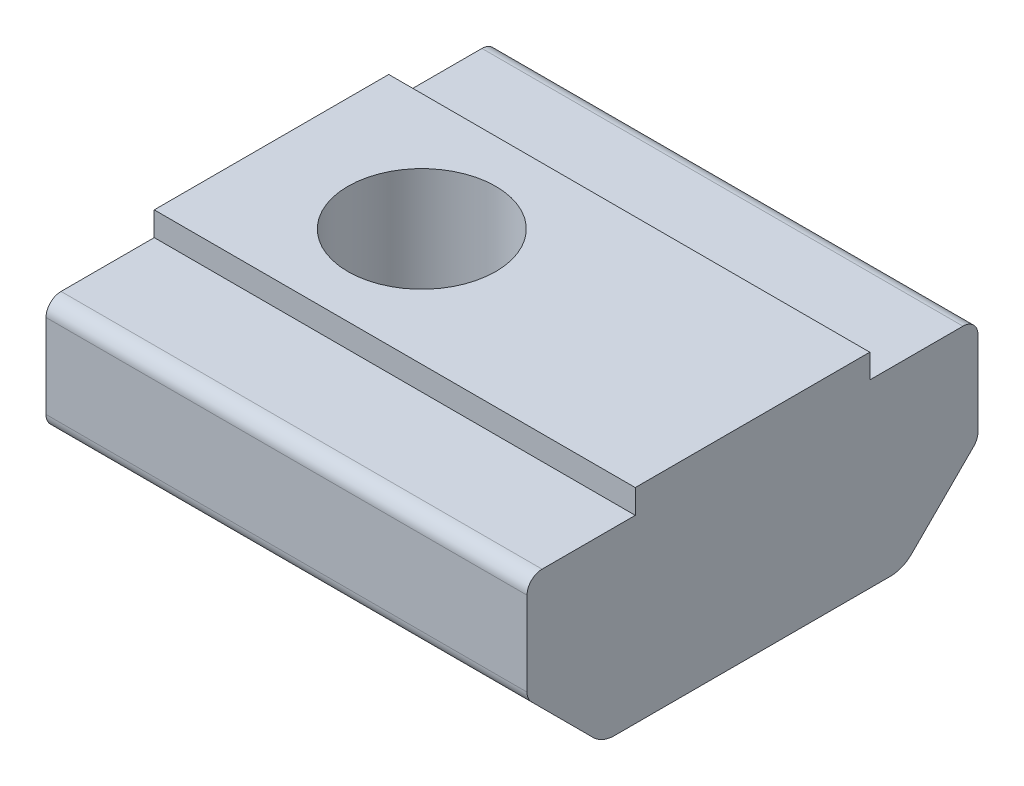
from build123d import *

# Parameters (mm, degrees)
BOSS_EXTRUDE1_DEPTH = 16
FILLET1_R           = 1
FILLET2_R           = 0.5
SKETCH2_W           = 2.35
SKETCH2_H           = 0.2
TAPPED_HOLE1_D      = 4.917


with BuildPart() as part:
    # Sketch1 → Boss-Extrude1 (new body)
    with BuildSketch(Plane(origin=(-5, 0, 0), x_dir=(0, 0, -1), z_dir=(1, 0, 0))):
        Polygon((3.9, 0), (-3.9, 0), (-3.9, -0.8), (-7.5, -0.8), (-7.5, -4.3), (-5, -6.8), (5, -6.8), (7.5, -4.3), (7.5, -0.8), (3.9, -0.8), align=None)
    extrude(amount=BOSS_EXTRUDE1_DEPTH)

    # Fillet1
    fillet1_edges = [part.edges().sort_by_distance(p)[0] for p in [
        (3, -6.8, -5),
        (3, -6.8, 5),
    ]]
    fillet(fillet1_edges, radius=FILLET1_R)

    # Fillet2
    fillet2_edges = [part.edges().sort_by_distance(p)[0] for p in [
        (3, -0.8, 7.5),
        (3, -0.8, -7.5),
        (3, -4.3, -7.5),
        (3, -4.3, 7.5),
    ]]
    fillet(fillet2_edges, radius=FILLET2_R)

    # Sketch2 → Cut-Revolve1 (revolve, cut)
    with BuildSketch(Plane(origin=(7, 0, 0), x_dir=(0, 0, -1), z_dir=(1, 0, 0)), mode=Mode.PRIVATE) as cut_revolve1_sk:
        with Locations((1.175, -6.7)):
            Rectangle(SKETCH2_W, SKETCH2_H)
    revolve(cut_revolve1_sk.sketch.rotate(Axis((7, 1.665548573, 0), (0, -1, 0)), 180), axis=Axis((7, 1.665548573, 0), (0, -1, 0)), mode=Mode.SUBTRACT)

    # Sketch3 → Revolve1 (revolve)
    with BuildSketch(Plane(origin=(7, 0, 0), x_dir=(0, 0, -1), z_dir=(1, 0, 0)), mode=Mode.PRIVATE) as revolve1_sk:
        with BuildLine():
            Line((1.989974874, -6.6), (0, -6.6))
            Line((0, -6.6), (0, -7.8))
            ThreePointArc((0, -7.8), (1.161895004, -7.476784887), (1.989974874, -6.6))
        make_face()
    revolve(revolve1_sk.sketch.rotate(Axis((7, 0, 0), (0, -1, 0)), 180), axis=Axis((7, 0, 0), (0, -1, 0)))

    # Tapped Hole1 (through all)
    with Locations(Plane(origin=(0, 0, 0), x_dir=(1, 0, 0), z_dir=(0, 1, 0))):
        with Locations((0, 0)):
            Hole(TAPPED_HOLE1_D / 2)


solid = part.part
